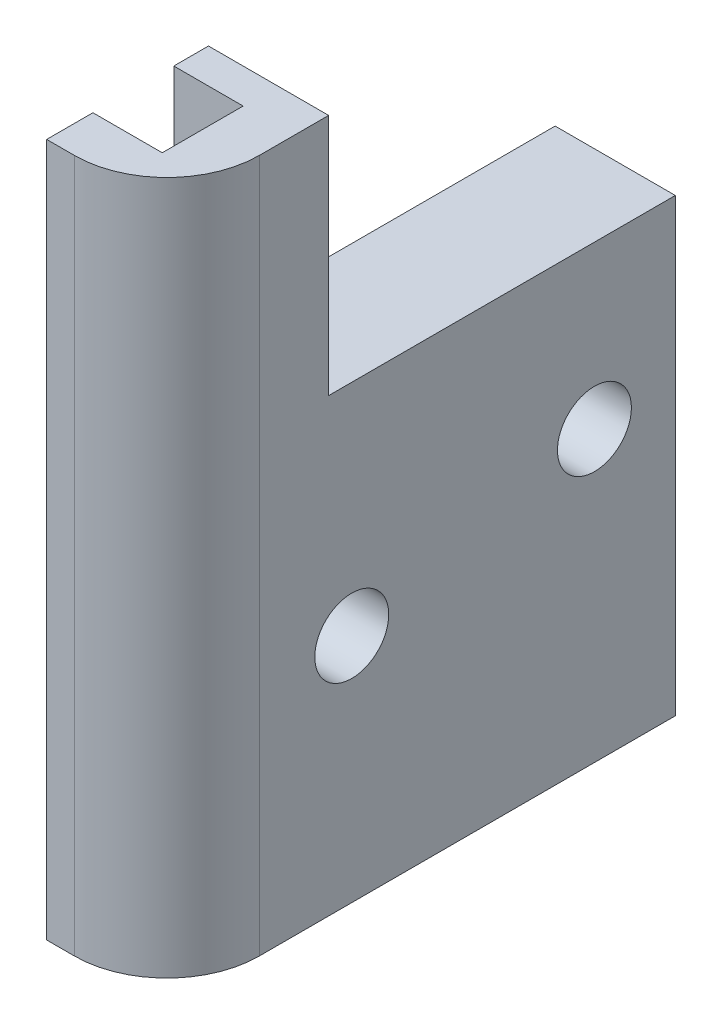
ISO-10303-21;
HEADER;
FILE_DESCRIPTION(('STEP AP214'),'2;1');
FILE_NAME('part.step','',(''),(''),'','','');
FILE_SCHEMA(('AUTOMOTIVE_DESIGN { 1 0 10303 214 1 1 1 1 }'));
ENDSEC;
DATA;
#1=APPLICATION_CONTEXT('core data for automotive mechanical design processes');
#2=APPLICATION_PROTOCOL_DEFINITION('international standard','automotive_design',2000,#1);
#3=PRODUCT_CONTEXT('',#1,'mechanical');
#4=PRODUCT('Part','Part','',(#3));
#5=PRODUCT_RELATED_PRODUCT_CATEGORY('part','',(#4));
#6=PRODUCT_DEFINITION_FORMATION('','',#4);
#7=PRODUCT_DEFINITION_CONTEXT('part definition',#1,'design');
#8=PRODUCT_DEFINITION('design','',#6,#7);
#9=PRODUCT_DEFINITION_SHAPE('','',#8);
#10=(LENGTH_UNIT() NAMED_UNIT(*) SI_UNIT(.MILLI.,.METRE.));
#11=(NAMED_UNIT(*) PLANE_ANGLE_UNIT() SI_UNIT($,.RADIAN.));
#12=(NAMED_UNIT(*) SI_UNIT($,.STERADIAN.) SOLID_ANGLE_UNIT());
#13=UNCERTAINTY_MEASURE_WITH_UNIT(LENGTH_MEASURE(1.E-05),#10,'distance_accuracy_value','');
#14=(GEOMETRIC_REPRESENTATION_CONTEXT(3) GLOBAL_UNCERTAINTY_ASSIGNED_CONTEXT((#13)) GLOBAL_UNIT_ASSIGNED_CONTEXT((#10,
#11,#12)) REPRESENTATION_CONTEXT('',''));
#15=CARTESIAN_POINT('',(0.,0.,0.));
#16=DIRECTION('',(0.,0.,1.));
#17=DIRECTION('',(1.,0.,0.));
#18=AXIS2_PLACEMENT_3D('',#15,#16,#17);
#19=CARTESIAN_POINT('',(5.2,19.5,0.));
#20=DIRECTION('',(0.,0.,1.));
#21=DIRECTION('',(1.,0.,0.));
#22=AXIS2_PLACEMENT_3D('',#19,#20,#21);
#23=PLANE('',#22);
#24=DIRECTION('',(0.,1.,0.));
#25=VECTOR('',#24,1.);
#26=CARTESIAN_POINT('',(0.,19.5,0.));
#27=LINE('',#26,#25);
#28=CARTESIAN_POINT('',(0.,0.,0.));
#29=VERTEX_POINT('',#28);
#30=CARTESIAN_POINT('',(0.,19.5,0.));
#31=VERTEX_POINT('',#30);
#32=EDGE_CURVE('E216',#29,#31,#27,.T.);
#33=ORIENTED_EDGE('',*,*,#32,.T.);
#34=DIRECTION('',(-1.,0.,0.));
#35=VECTOR('',#34,1.);
#36=CARTESIAN_POINT('',(5.2,19.5,0.));
#37=LINE('',#36,#35);
#38=CARTESIAN_POINT('',(5.2,19.5,0.));
#39=VERTEX_POINT('',#38);
#40=EDGE_CURVE('E261',#39,#31,#37,.T.);
#41=ORIENTED_EDGE('',*,*,#40,.F.);
#42=DIRECTION('',(0.,1.,0.));
#43=VECTOR('',#42,1.);
#44=CARTESIAN_POINT('',(5.2,19.5,0.));
#45=LINE('',#44,#43);
#46=CARTESIAN_POINT('',(5.2,0.,0.));
#47=VERTEX_POINT('',#46);
#48=EDGE_CURVE('E221',#47,#39,#45,.T.);
#49=ORIENTED_EDGE('',*,*,#48,.F.);
#50=DIRECTION('',(-1.,0.,0.));
#51=VECTOR('',#50,1.);
#52=CARTESIAN_POINT('',(5.2,0.,0.));
#53=LINE('',#52,#51);
#54=EDGE_CURVE('E234',#47,#29,#53,.T.);
#55=ORIENTED_EDGE('',*,*,#54,.T.);
#56=EDGE_LOOP('',(#33,#41,#49,#55));
#57=FACE_BOUND('',#56,.T.);
#58=ADVANCED_FACE('F33',(#57),#23,.F.);
#59=CARTESIAN_POINT('',(5.2,19.5,15.));
#60=DIRECTION('',(0.,-1.,0.));
#61=DIRECTION('',(0.,0.,-1.));
#62=AXIS2_PLACEMENT_3D('',#59,#60,#61);
#63=PLANE('',#62);
#64=DIRECTION('',(0.,0.,1.));
#65=VECTOR('',#64,1.);
#66=CARTESIAN_POINT('',(0.,19.5,15.));
#67=LINE('',#66,#65);
#68=CARTESIAN_POINT('',(0.,19.5,15.));
#69=VERTEX_POINT('',#68);
#70=EDGE_CURVE('E237',#31,#69,#67,.T.);
#71=ORIENTED_EDGE('',*,*,#70,.T.);
#72=DIRECTION('',(-1.,0.,0.));
#73=VECTOR('',#72,1.);
#74=CARTESIAN_POINT('',(5.2,19.5,15.));
#75=LINE('',#74,#73);
#76=CARTESIAN_POINT('',(5.2,19.5,15.));
#77=VERTEX_POINT('',#76);
#78=EDGE_CURVE('E258',#77,#69,#75,.T.);
#79=ORIENTED_EDGE('',*,*,#78,.F.);
#80=DIRECTION('',(0.,0.,1.));
#81=VECTOR('',#80,1.);
#82=CARTESIAN_POINT('',(5.2,19.5,15.));
#83=LINE('',#82,#81);
#84=EDGE_CURVE('E224',#39,#77,#83,.T.);
#85=ORIENTED_EDGE('',*,*,#84,.F.);
#86=ORIENTED_EDGE('',*,*,#40,.T.);
#87=EDGE_LOOP('',(#71,#79,#85,#86));
#88=FACE_BOUND('',#87,.T.);
#89=ADVANCED_FACE('F312',(#88),#63,.F.);
#90=CARTESIAN_POINT('',(5.2,30.,15.));
#91=DIRECTION('',(0.,0.,1.));
#92=DIRECTION('',(0.,-1.,0.));
#93=AXIS2_PLACEMENT_3D('',#90,#91,#92);
#94=PLANE('',#93);
#95=DIRECTION('',(0.,1.,0.));
#96=VECTOR('',#95,1.);
#97=CARTESIAN_POINT('',(0.,30.,15.));
#98=LINE('',#97,#96);
#99=CARTESIAN_POINT('',(0.,30.,15.));
#100=VERTEX_POINT('',#99);
#101=EDGE_CURVE('E239',#69,#100,#98,.T.);
#102=ORIENTED_EDGE('',*,*,#101,.T.);
#103=DIRECTION('',(-1.,0.,0.));
#104=VECTOR('',#103,1.);
#105=CARTESIAN_POINT('',(5.2,30.,15.));
#106=LINE('',#105,#104);
#107=CARTESIAN_POINT('',(5.2,30.,15.));
#108=VERTEX_POINT('',#107);
#109=EDGE_CURVE('E255',#108,#100,#106,.T.);
#110=ORIENTED_EDGE('',*,*,#109,.F.);
#111=DIRECTION('',(0.,1.,0.));
#112=VECTOR('',#111,1.);
#113=CARTESIAN_POINT('',(5.2,30.,15.));
#114=LINE('',#113,#112);
#115=EDGE_CURVE('E227',#77,#108,#114,.T.);
#116=ORIENTED_EDGE('',*,*,#115,.F.);
#117=ORIENTED_EDGE('',*,*,#78,.T.);
#118=EDGE_LOOP('',(#102,#110,#116,#117));
#119=FACE_BOUND('',#118,.T.);
#120=ADVANCED_FACE('F315',(#119),#94,.F.);
#121=CARTESIAN_POINT('',(5.2,30.,22.));
#122=DIRECTION('',(0.,-1.,0.));
#123=DIRECTION('',(0.,0.,-1.));
#124=AXIS2_PLACEMENT_3D('',#121,#122,#123);
#125=PLANE('',#124);
#126=DIRECTION('',(-1.,0.,0.));
#127=VECTOR('',#126,1.);
#128=CARTESIAN_POINT('',(5.2,30.,22.));
#129=LINE('',#128,#127);
#130=CARTESIAN_POINT('',(1.2,30.,22.));
#131=VERTEX_POINT('',#130);
#132=CARTESIAN_POINT('',(0.,30.,22.));
#133=VERTEX_POINT('',#132);
#134=EDGE_CURVE('E253',#131,#133,#129,.T.);
#135=ORIENTED_EDGE('',*,*,#134,.F.);
#136=CARTESIAN_POINT('',(1.2,30.,18.));
#137=DIRECTION('',(0.,-1.,0.));
#138=DIRECTION('',(0.,0.,-1.));
#139=AXIS2_PLACEMENT_3D('',#136,#137,#138);
#140=CIRCLE('',#139,4.);
#141=CARTESIAN_POINT('',(5.2,30.,18.));
#142=VERTEX_POINT('',#141);
#143=EDGE_CURVE('E11',#131,#142,#140,.F.);
#144=ORIENTED_EDGE('',*,*,#143,.T.);
#145=DIRECTION('',(0.,0.,1.));
#146=VECTOR('',#145,1.);
#147=CARTESIAN_POINT('',(5.2,30.,22.));
#148=LINE('',#147,#146);
#149=EDGE_CURVE('E229',#108,#142,#148,.T.);
#150=ORIENTED_EDGE('',*,*,#149,.F.);
#151=ORIENTED_EDGE('',*,*,#109,.T.);
#152=DIRECTION('',(0.,0.,1.));
#153=VECTOR('',#152,1.);
#154=CARTESIAN_POINT('',(0.,30.,22.));
#155=LINE('',#154,#153);
#156=CARTESIAN_POINT('',(0.,30.,16.5));
#157=VERTEX_POINT('',#156);
#158=EDGE_CURVE('E242',#100,#157,#155,.T.);
#159=ORIENTED_EDGE('',*,*,#158,.T.);
#160=DIRECTION('',(-1.,0.,0.));
#161=VECTOR('',#160,1.);
#162=CARTESIAN_POINT('',(3.,30.,16.5));
#163=LINE('',#162,#161);
#164=CARTESIAN_POINT('',(3.,30.,16.5));
#165=VERTEX_POINT('',#164);
#166=EDGE_CURVE('E177',#165,#157,#163,.T.);
#167=ORIENTED_EDGE('',*,*,#166,.F.);
#168=DIRECTION('',(0.,0.,-1.));
#169=VECTOR('',#168,1.);
#170=CARTESIAN_POINT('',(3.,30.,20.));
#171=LINE('',#170,#169);
#172=CARTESIAN_POINT('',(3.,30.,20.));
#173=VERTEX_POINT('',#172);
#174=EDGE_CURVE('E187',#173,#165,#171,.T.);
#175=ORIENTED_EDGE('',*,*,#174,.F.);
#176=DIRECTION('',(-1.,0.,0.));
#177=VECTOR('',#176,1.);
#178=CARTESIAN_POINT('',(3.,30.,20.));
#179=LINE('',#178,#177);
#180=CARTESIAN_POINT('',(0.,30.,20.));
#181=VERTEX_POINT('',#180);
#182=EDGE_CURVE('E213',#173,#181,#179,.T.);
#183=ORIENTED_EDGE('',*,*,#182,.T.);
#184=EDGE_CURVE('E241',#181,#133,#155,.T.);
#185=ORIENTED_EDGE('',*,*,#184,.T.);
#186=EDGE_LOOP('',(#135,#144,#150,#151,#159,#167,#175,#183,#185));
#187=FACE_BOUND('',#186,.T.);
#188=ADVANCED_FACE('F318',(#187),#125,.F.);
#189=CARTESIAN_POINT('',(5.2,0.,22.));
#190=DIRECTION('',(0.,0.,-1.));
#191=DIRECTION('',(-1.,0.,0.));
#192=AXIS2_PLACEMENT_3D('',#189,#190,#191);
#193=PLANE('',#192);
#194=DIRECTION('',(-1.,0.,0.));
#195=VECTOR('',#194,1.);
#196=CARTESIAN_POINT('',(5.2,0.,22.));
#197=LINE('',#196,#195);
#198=CARTESIAN_POINT('',(1.2,0.,22.));
#199=VERTEX_POINT('',#198);
#200=CARTESIAN_POINT('',(0.,0.,22.));
#201=VERTEX_POINT('',#200);
#202=EDGE_CURVE('E251',#199,#201,#197,.T.);
#203=ORIENTED_EDGE('',*,*,#202,.F.);
#204=DIRECTION('',(0.,-1.,0.));
#205=VECTOR('',#204,1.);
#206=CARTESIAN_POINT('',(1.2,0.,22.));
#207=LINE('',#206,#205);
#208=EDGE_CURVE('E41',#199,#131,#207,.F.);
#209=ORIENTED_EDGE('',*,*,#208,.T.);
#210=ORIENTED_EDGE('',*,*,#134,.T.);
#211=DIRECTION('',(0.,-1.,0.));
#212=VECTOR('',#211,1.);
#213=CARTESIAN_POINT('',(0.,0.,22.));
#214=LINE('',#213,#212);
#215=EDGE_CURVE('E245',#133,#201,#214,.T.);
#216=ORIENTED_EDGE('',*,*,#215,.T.);
#217=EDGE_LOOP('',(#203,#209,#210,#216));
#218=FACE_BOUND('',#217,.T.);
#219=ADVANCED_FACE('F387',(#218),#193,.F.);
#220=CARTESIAN_POINT('',(5.2,0.,0.));
#221=DIRECTION('',(0.,1.,0.));
#222=DIRECTION('',(0.,0.,1.));
#223=AXIS2_PLACEMENT_3D('',#220,#221,#222);
#224=PLANE('',#223);
#225=DIRECTION('',(0.,0.,-1.));
#226=VECTOR('',#225,1.);
#227=CARTESIAN_POINT('',(5.2,0.,0.));
#228=LINE('',#227,#226);
#229=CARTESIAN_POINT('',(5.2,0.,18.));
#230=VERTEX_POINT('',#229);
#231=EDGE_CURVE('E232',#230,#47,#228,.T.);
#232=ORIENTED_EDGE('',*,*,#231,.F.);
#233=CARTESIAN_POINT('',(1.2,0.,18.));
#234=DIRECTION('',(0.,1.,0.));
#235=DIRECTION('',(0.,0.,1.));
#236=AXIS2_PLACEMENT_3D('',#233,#234,#235);
#237=CIRCLE('',#236,4.);
#238=EDGE_CURVE('E55',#230,#199,#237,.F.);
#239=ORIENTED_EDGE('',*,*,#238,.T.);
#240=ORIENTED_EDGE('',*,*,#202,.T.);
#241=DIRECTION('',(0.,0.,-1.));
#242=VECTOR('',#241,1.);
#243=CARTESIAN_POINT('',(0.,0.,0.));
#244=LINE('',#243,#242);
#245=EDGE_CURVE('E225',#201,#29,#244,.T.);
#246=ORIENTED_EDGE('',*,*,#245,.T.);
#247=ORIENTED_EDGE('',*,*,#54,.F.);
#248=EDGE_LOOP('',(#232,#239,#240,#246,#247));
#249=FACE_BOUND('',#248,.T.);
#250=ADVANCED_FACE('F302',(#249),#224,.F.);
#251=CARTESIAN_POINT('',(5.2,0.,0.));
#252=DIRECTION('',(-1.,0.,0.));
#253=DIRECTION('',(0.,0.,1.));
#254=AXIS2_PLACEMENT_3D('',#251,#252,#253);
#255=PLANE('',#254);
#256=CARTESIAN_POINT('',(5.2,10.,14.));
#257=DIRECTION('',(1.,0.,0.));
#258=DIRECTION('',(0.,0.,-1.));
#259=AXIS2_PLACEMENT_3D('',#256,#257,#258);
#260=CIRCLE('',#259,1.6);
#261=CARTESIAN_POINT('',(5.2,10.,12.4));
#262=VERTEX_POINT('',#261);
#263=EDGE_CURVE('E166',#262,#262,#260,.T.);
#264=ORIENTED_EDGE('',*,*,#263,.F.);
#265=EDGE_LOOP('',(#264));
#266=FACE_BOUND('',#265,.T.);
#267=CARTESIAN_POINT('',(5.2,12.5,3.5));
#268=DIRECTION('',(1.,0.,0.));
#269=DIRECTION('',(0.,0.,-1.));
#270=AXIS2_PLACEMENT_3D('',#267,#268,#269);
#271=CIRCLE('',#270,1.6);
#272=CARTESIAN_POINT('',(5.2,12.5,1.9));
#273=VERTEX_POINT('',#272);
#274=EDGE_CURVE('E550',#273,#273,#271,.T.);
#275=ORIENTED_EDGE('',*,*,#274,.F.);
#276=EDGE_LOOP('',(#275));
#277=FACE_BOUND('',#276,.T.);
#278=ORIENTED_EDGE('',*,*,#149,.T.);
#279=DIRECTION('',(0.,-1.,0.));
#280=VECTOR('',#279,1.);
#281=CARTESIAN_POINT('',(5.2,0.,18.));
#282=LINE('',#281,#280);
#283=EDGE_CURVE('E292',#142,#230,#282,.T.);
#284=ORIENTED_EDGE('',*,*,#283,.T.);
#285=ORIENTED_EDGE('',*,*,#231,.T.);
#286=ORIENTED_EDGE('',*,*,#48,.T.);
#287=ORIENTED_EDGE('',*,*,#84,.T.);
#288=ORIENTED_EDGE('',*,*,#115,.T.);
#289=EDGE_LOOP('',(#278,#284,#285,#286,#287,#288));
#290=FACE_BOUND('',#289,.T.);
#291=ADVANCED_FACE('F297',(#266,#277,#290),#255,.F.);
#292=CARTESIAN_POINT('',(0.,0.,0.));
#293=DIRECTION('',(-1.,0.,0.));
#294=DIRECTION('',(0.,0.,1.));
#295=AXIS2_PLACEMENT_3D('',#292,#293,#294);
#296=PLANE('',#295);
#297=CARTESIAN_POINT('',(0.,10.,14.));
#298=DIRECTION('',(-1.,0.,0.));
#299=DIRECTION('',(0.,0.,1.));
#300=AXIS2_PLACEMENT_3D('',#297,#298,#299);
#301=CIRCLE('',#300,1.6);
#302=CARTESIAN_POINT('',(0.,10.,15.6));
#303=VERTEX_POINT('',#302);
#304=EDGE_CURVE('E546',#303,#303,#301,.F.);
#305=ORIENTED_EDGE('',*,*,#304,.T.);
#306=EDGE_LOOP('',(#305));
#307=FACE_BOUND('',#306,.T.);
#308=CARTESIAN_POINT('',(0.,12.5,3.5));
#309=DIRECTION('',(-1.,0.,0.));
#310=DIRECTION('',(0.,0.,1.));
#311=AXIS2_PLACEMENT_3D('',#308,#309,#310);
#312=CIRCLE('',#311,1.6);
#313=CARTESIAN_POINT('',(0.,12.5,5.1));
#314=VERTEX_POINT('',#313);
#315=EDGE_CURVE('E549',#314,#314,#312,.F.);
#316=ORIENTED_EDGE('',*,*,#315,.T.);
#317=EDGE_LOOP('',(#316));
#318=FACE_BOUND('',#317,.T.);
#319=DIRECTION('',(0.,0.37303194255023,-0.927818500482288));
#320=VECTOR('',#319,1.);
#321=CARTESIAN_POINT('',(0.,9.94870290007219,6.67864374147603));
#322=LINE('',#321,#320);
#323=CARTESIAN_POINT('',(0.,7.65609364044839,12.3809041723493));
#324=VERTEX_POINT('',#323);
#325=CARTESIAN_POINT('',(0.,9.94870290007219,6.67864374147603));
#326=VERTEX_POINT('',#325);
#327=EDGE_CURVE('E172',#324,#326,#322,.T.);
#328=ORIENTED_EDGE('',*,*,#327,.F.);
#329=CARTESIAN_POINT('',(0.,10.4395491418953,13.5));
#330=DIRECTION('',(-1.,0.,0.));
#331=DIRECTION('',(0.,0.,1.));
#332=AXIS2_PLACEMENT_3D('',#329,#330,#331);
#333=CIRCLE('',#332,3.);
#334=CARTESIAN_POINT('',(0.,10.4395491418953,16.5));
#335=VERTEX_POINT('',#334);
#336=EDGE_CURVE('E273',#324,#335,#333,.T.);
#337=ORIENTED_EDGE('',*,*,#336,.T.);
#338=DIRECTION('',(0.,-1.,0.));
#339=VECTOR('',#338,1.);
#340=CARTESIAN_POINT('',(0.,30.,16.5));
#341=LINE('',#340,#339);
#342=EDGE_CURVE('E183',#157,#335,#341,.T.);
#343=ORIENTED_EDGE('',*,*,#342,.F.);
#344=ORIENTED_EDGE('',*,*,#158,.F.);
#345=ORIENTED_EDGE('',*,*,#101,.F.);
#346=ORIENTED_EDGE('',*,*,#70,.F.);
#347=ORIENTED_EDGE('',*,*,#32,.F.);
#348=ORIENTED_EDGE('',*,*,#245,.F.);
#349=ORIENTED_EDGE('',*,*,#215,.F.);
#350=ORIENTED_EDGE('',*,*,#184,.F.);
#351=DIRECTION('',(0.,1.,0.));
#352=VECTOR('',#351,1.);
#353=CARTESIAN_POINT('',(0.,2.5,20.));
#354=LINE('',#353,#352);
#355=CARTESIAN_POINT('',(0.,5.5,20.));
#356=VERTEX_POINT('',#355);
#357=EDGE_CURVE('E191',#356,#181,#354,.T.);
#358=ORIENTED_EDGE('',*,*,#357,.F.);
#359=CARTESIAN_POINT('',(0.,5.5,17.));
#360=DIRECTION('',(-1.,0.,0.));
#361=DIRECTION('',(0.,0.,1.));
#362=AXIS2_PLACEMENT_3D('',#359,#360,#361);
#363=CIRCLE('',#362,3.);
#364=CARTESIAN_POINT('',(0.,2.5,17.));
#365=VERTEX_POINT('',#364);
#366=EDGE_CURVE('E277',#356,#365,#363,.F.);
#367=ORIENTED_EDGE('',*,*,#366,.T.);
#368=DIRECTION('',(0.,0.,1.));
#369=VECTOR('',#368,1.);
#370=CARTESIAN_POINT('',(0.,2.5,16.5));
#371=LINE('',#370,#369);
#372=CARTESIAN_POINT('',(0.,2.5,16.5));
#373=VERTEX_POINT('',#372);
#374=EDGE_CURVE('E209',#373,#365,#371,.T.);
#375=ORIENTED_EDGE('',*,*,#374,.F.);
#376=DIRECTION('',(0.,0.108325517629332,0.994115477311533));
#377=VECTOR('',#376,1.);
#378=CARTESIAN_POINT('',(0.,1.3,5.48746482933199));
#379=LINE('',#378,#377);
#380=CARTESIAN_POINT('',(0.,1.3,5.48746482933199));
#381=VERTEX_POINT('',#380);
#382=EDGE_CURVE('E206',#381,#373,#379,.T.);
#383=ORIENTED_EDGE('',*,*,#382,.F.);
#384=CARTESIAN_POINT('',(0.,5.7735196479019,5.));
#385=DIRECTION('',(-1.,0.,0.));
#386=DIRECTION('',(0.,0.,1.));
#387=AXIS2_PLACEMENT_3D('',#384,#385,#386);
#388=CIRCLE('',#387,4.5);
#389=EDGE_CURVE('E204',#326,#381,#388,.T.);
#390=ORIENTED_EDGE('',*,*,#389,.F.);
#391=EDGE_LOOP('',(#328,#337,#343,#344,#345,#346,#347,#348,#349,#350,#358,#367,#375,#383,#390));
#392=FACE_BOUND('',#391,.T.);
#393=ADVANCED_FACE('F368',(#307,#318,#392),#296,.T.);
#394=CARTESIAN_POINT('',(3.,2.5,20.));
#395=DIRECTION('',(0.,0.,1.));
#396=DIRECTION('',(1.,0.,0.));
#397=AXIS2_PLACEMENT_3D('',#394,#395,#396);
#398=PLANE('',#397);
#399=DIRECTION('',(0.,1.,0.));
#400=VECTOR('',#399,1.);
#401=CARTESIAN_POINT('',(3.,2.5,20.));
#402=LINE('',#401,#400);
#403=CARTESIAN_POINT('',(3.,5.5,20.));
#404=VERTEX_POINT('',#403);
#405=EDGE_CURVE('E199',#404,#173,#402,.T.);
#406=ORIENTED_EDGE('',*,*,#405,.F.);
#407=DIRECTION('',(-1.,0.,0.));
#408=VECTOR('',#407,1.);
#409=CARTESIAN_POINT('',(0.,5.5,20.));
#410=LINE('',#409,#408);
#411=EDGE_CURVE('E264',#404,#356,#410,.T.);
#412=ORIENTED_EDGE('',*,*,#411,.T.);
#413=ORIENTED_EDGE('',*,*,#357,.T.);
#414=ORIENTED_EDGE('',*,*,#182,.F.);
#415=EDGE_LOOP('',(#406,#412,#413,#414));
#416=FACE_BOUND('',#415,.T.);
#417=ADVANCED_FACE('F380',(#416),#398,.F.);
#418=CARTESIAN_POINT('',(3.,2.5,16.5));
#419=DIRECTION('',(0.,-1.,0.));
#420=DIRECTION('',(0.,0.,-1.));
#421=AXIS2_PLACEMENT_3D('',#418,#419,#420);
#422=PLANE('',#421);
#423=ORIENTED_EDGE('',*,*,#374,.T.);
#424=DIRECTION('',(-1.,0.,0.));
#425=VECTOR('',#424,1.);
#426=CARTESIAN_POINT('',(3.,2.5,17.));
#427=LINE('',#426,#425);
#428=CARTESIAN_POINT('',(3.,2.5,17.));
#429=VERTEX_POINT('',#428);
#430=EDGE_CURVE('E267',#365,#429,#427,.F.);
#431=ORIENTED_EDGE('',*,*,#430,.T.);
#432=DIRECTION('',(0.,0.,1.));
#433=VECTOR('',#432,1.);
#434=CARTESIAN_POINT('',(3.,2.5,16.5));
#435=LINE('',#434,#433);
#436=CARTESIAN_POINT('',(3.,2.5,16.5));
#437=VERTEX_POINT('',#436);
#438=EDGE_CURVE('E196',#437,#429,#435,.T.);
#439=ORIENTED_EDGE('',*,*,#438,.F.);
#440=DIRECTION('',(-1.,0.,0.));
#441=VECTOR('',#440,1.);
#442=CARTESIAN_POINT('',(3.,2.5,16.5));
#443=LINE('',#442,#441);
#444=EDGE_CURVE('E217',#437,#373,#443,.T.);
#445=ORIENTED_EDGE('',*,*,#444,.T.);
#446=EDGE_LOOP('',(#423,#431,#439,#445));
#447=FACE_BOUND('',#446,.T.);
#448=ADVANCED_FACE('F374',(#447),#422,.F.);
#449=CARTESIAN_POINT('',(3.,1.3,5.48746482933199));
#450=DIRECTION('',(0.,-0.994115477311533,0.108325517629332));
#451=DIRECTION('',(0.,-0.108325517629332,-0.994115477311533));
#452=AXIS2_PLACEMENT_3D('',#449,#450,#451);
#453=PLANE('',#452);
#454=DIRECTION('',(0.,0.108325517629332,0.994115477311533));
#455=VECTOR('',#454,1.);
#456=CARTESIAN_POINT('',(3.,1.3,5.48746482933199));
#457=LINE('',#456,#455);
#458=CARTESIAN_POINT('',(3.,2.24582390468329,14.1673973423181));
#459=VERTEX_POINT('',#458);
#460=EDGE_CURVE('E194',#459,#437,#457,.T.);
#461=ORIENTED_EDGE('',*,*,#460,.F.);
#462=DIRECTION('',(0.499999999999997,-0.093812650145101,-0.860929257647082));
#463=VECTOR('',#462,1.);
#464=CARTESIAN_POINT('',(4.3,2.00191101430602,11.9289812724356));
#465=LINE('',#464,#463);
#466=CARTESIAN_POINT('',(4.3,2.00191101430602,11.9289812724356));
#467=VERTEX_POINT('',#466);
#468=EDGE_CURVE('E287',#459,#467,#465,.T.);
#469=ORIENTED_EDGE('',*,*,#468,.T.);
#470=DIRECTION('',(0.,0.108325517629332,0.994115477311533));
#471=VECTOR('',#470,1.);
#472=CARTESIAN_POINT('',(4.3,1.3,5.48746482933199));
#473=LINE('',#472,#471);
#474=CARTESIAN_POINT('',(4.3,1.3,5.48746482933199));
#475=VERTEX_POINT('',#474);
#476=EDGE_CURVE('E181',#475,#467,#473,.T.);
#477=ORIENTED_EDGE('',*,*,#476,.F.);
#478=DIRECTION('',(-1.,0.,0.));
#479=VECTOR('',#478,1.);
#480=CARTESIAN_POINT('',(3.,1.3,5.48746482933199));
#481=LINE('',#480,#479);
#482=EDGE_CURVE('E176',#475,#381,#481,.T.);
#483=ORIENTED_EDGE('',*,*,#482,.T.);
#484=ORIENTED_EDGE('',*,*,#382,.T.);
#485=ORIENTED_EDGE('',*,*,#444,.F.);
#486=EDGE_LOOP('',(#461,#469,#477,#483,#484,#485));
#487=FACE_BOUND('',#486,.T.);
#488=ADVANCED_FACE('F358',(#487),#453,.F.);
#489=CARTESIAN_POINT('',(3.,5.7735196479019,5.));
#490=DIRECTION('',(-1.,0.,0.));
#491=DIRECTION('',(0.,0.,1.));
#492=AXIS2_PLACEMENT_3D('',#489,#490,#491);
#493=CYLINDRICAL_SURFACE('',#492,4.5);
#494=ORIENTED_EDGE('',*,*,#389,.T.);
#495=ORIENTED_EDGE('',*,*,#482,.F.);
#496=CARTESIAN_POINT('',(4.3,5.7735196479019,5.));
#497=DIRECTION('',(-1.,0.,0.));
#498=DIRECTION('',(0.,0.,1.));
#499=AXIS2_PLACEMENT_3D('',#496,#497,#498);
#500=CIRCLE('',#499,4.5);
#501=CARTESIAN_POINT('',(4.3,9.94870290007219,6.67864374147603));
#502=VERTEX_POINT('',#501);
#503=EDGE_CURVE('E162',#502,#475,#500,.T.);
#504=ORIENTED_EDGE('',*,*,#503,.F.);
#505=DIRECTION('',(-1.,0.,0.));
#506=VECTOR('',#505,1.);
#507=CARTESIAN_POINT('',(3.,9.94870290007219,6.67864374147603));
#508=LINE('',#507,#506);
#509=EDGE_CURVE('E169',#502,#326,#508,.T.);
#510=ORIENTED_EDGE('',*,*,#509,.T.);
#511=EDGE_LOOP('',(#494,#495,#504,#510));
#512=FACE_BOUND('',#511,.T.);
#513=ADVANCED_FACE('F179',(#512),#493,.F.);
#514=CARTESIAN_POINT('',(3.,9.94870290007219,6.67864374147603));
#515=DIRECTION('',(0.,0.927818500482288,0.37303194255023));
#516=DIRECTION('',(0.,-0.37303194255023,0.927818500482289));
#517=AXIS2_PLACEMENT_3D('',#514,#515,#516);
#518=PLANE('',#517);
#519=DIRECTION('',(0.,0.37303194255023,-0.927818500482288));
#520=VECTOR('',#519,1.);
#521=CARTESIAN_POINT('',(4.3,7.65609364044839,12.3809041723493));
#522=LINE('',#521,#520);
#523=CARTESIAN_POINT('',(4.3,8.10517680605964,11.2639283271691));
#524=VERTEX_POINT('',#523);
#525=EDGE_CURVE('E157',#524,#502,#522,.T.);
#526=ORIENTED_EDGE('',*,*,#525,.F.);
#527=DIRECTION('',(-0.453755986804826,-0.332418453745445,0.826803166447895));
#528=VECTOR('',#527,1.);
#529=CARTESIAN_POINT('',(4.69612332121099,8.39537397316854,10.5421394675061));
#530=LINE('',#529,#528);
#531=CARTESIAN_POINT('',(3.68699499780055,7.65609364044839,12.3809041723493));
#532=VERTEX_POINT('',#531);
#533=EDGE_CURVE('E285',#524,#532,#530,.T.);
#534=ORIENTED_EDGE('',*,*,#533,.T.);
#535=DIRECTION('',(-1.,0.,0.));
#536=VECTOR('',#535,1.);
#537=CARTESIAN_POINT('',(3.,7.65609364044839,12.3809041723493));
#538=LINE('',#537,#536);
#539=EDGE_CURVE('E271',#532,#324,#538,.T.);
#540=ORIENTED_EDGE('',*,*,#539,.T.);
#541=ORIENTED_EDGE('',*,*,#327,.T.);
#542=ORIENTED_EDGE('',*,*,#509,.F.);
#543=EDGE_LOOP('',(#526,#534,#540,#541,#542));
#544=FACE_BOUND('',#543,.T.);
#545=ADVANCED_FACE('F170',(#544),#518,.F.);
#546=CARTESIAN_POINT('',(3.,30.,16.5));
#547=DIRECTION('',(0.,0.,-1.));
#548=DIRECTION('',(-1.,0.,0.));
#549=AXIS2_PLACEMENT_3D('',#546,#547,#548);
#550=PLANE('',#549);
#551=ORIENTED_EDGE('',*,*,#342,.T.);
#552=DIRECTION('',(-1.,0.,0.));
#553=VECTOR('',#552,1.);
#554=CARTESIAN_POINT('',(3.,10.4395491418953,16.5));
#555=LINE('',#554,#553);
#556=CARTESIAN_POINT('',(3.,10.4395491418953,16.5));
#557=VERTEX_POINT('',#556);
#558=EDGE_CURVE('E275',#335,#557,#555,.F.);
#559=ORIENTED_EDGE('',*,*,#558,.T.);
#560=DIRECTION('',(0.,-1.,0.));
#561=VECTOR('',#560,1.);
#562=CARTESIAN_POINT('',(3.,30.,16.5));
#563=LINE('',#562,#561);
#564=EDGE_CURVE('E190',#165,#557,#563,.T.);
#565=ORIENTED_EDGE('',*,*,#564,.F.);
#566=ORIENTED_EDGE('',*,*,#166,.T.);
#567=EDGE_LOOP('',(#551,#559,#565,#566));
#568=FACE_BOUND('',#567,.T.);
#569=ADVANCED_FACE('F385',(#568),#550,.F.);
#570=CARTESIAN_POINT('',(3.,5.7735196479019,5.));
#571=DIRECTION('',(-1.,0.,0.));
#572=DIRECTION('',(0.,0.,1.));
#573=AXIS2_PLACEMENT_3D('',#570,#571,#572);
#574=PLANE('',#573);
#575=CARTESIAN_POINT('',(3.,10.4395491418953,13.5));
#576=DIRECTION('',(-1.,0.,0.));
#577=DIRECTION('',(0.,0.,1.));
#578=AXIS2_PLACEMENT_3D('',#575,#576,#577);
#579=CIRCLE('',#578,3.);
#580=CARTESIAN_POINT('',(3.,7.44125882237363,13.6012677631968));
#581=VERTEX_POINT('',#580);
#582=EDGE_CURVE('E279',#557,#581,#579,.F.);
#583=ORIENTED_EDGE('',*,*,#582,.T.);
#584=DIRECTION('',(0.,-0.994115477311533,0.108325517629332));
#585=VECTOR('',#584,1.);
#586=CARTESIAN_POINT('',(3.,10.4152712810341,13.2771993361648));
#587=LINE('',#586,#585);
#588=EDGE_CURVE('E289',#581,#459,#587,.T.);
#589=ORIENTED_EDGE('',*,*,#588,.T.);
#590=ORIENTED_EDGE('',*,*,#460,.T.);
#591=ORIENTED_EDGE('',*,*,#438,.T.);
#592=CARTESIAN_POINT('',(3.,5.5,17.));
#593=DIRECTION('',(-1.,0.,0.));
#594=DIRECTION('',(0.,0.,1.));
#595=AXIS2_PLACEMENT_3D('',#592,#593,#594);
#596=CIRCLE('',#595,3.);
#597=EDGE_CURVE('E269',#429,#404,#596,.T.);
#598=ORIENTED_EDGE('',*,*,#597,.T.);
#599=ORIENTED_EDGE('',*,*,#405,.T.);
#600=ORIENTED_EDGE('',*,*,#174,.T.);
#601=ORIENTED_EDGE('',*,*,#564,.T.);
#602=EDGE_LOOP('',(#583,#589,#590,#591,#598,#599,#600,#601));
#603=FACE_BOUND('',#602,.T.);
#604=ADVANCED_FACE('F340',(#603),#574,.T.);
#605=CARTESIAN_POINT('',(3.,5.5,17.));
#606=DIRECTION('',(1.,0.,0.));
#607=DIRECTION('',(0.,0.,-1.));
#608=AXIS2_PLACEMENT_3D('',#605,#606,#607);
#609=CYLINDRICAL_SURFACE('',#608,3.);
#610=ORIENTED_EDGE('',*,*,#597,.F.);
#611=ORIENTED_EDGE('',*,*,#430,.F.);
#612=ORIENTED_EDGE('',*,*,#366,.F.);
#613=ORIENTED_EDGE('',*,*,#411,.F.);
#614=EDGE_LOOP('',(#610,#611,#612,#613));
#615=FACE_BOUND('',#614,.T.);
#616=ADVANCED_FACE('F336',(#615),#609,.F.);
#617=CARTESIAN_POINT('',(3.,10.4395491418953,13.5));
#618=DIRECTION('',(-1.,0.,0.));
#619=DIRECTION('',(0.,0.,1.));
#620=AXIS2_PLACEMENT_3D('',#617,#618,#619);
#621=CYLINDRICAL_SURFACE('',#620,3.);
#622=CARTESIAN_POINT('',(2.87060454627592,10.4395491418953,13.5));
#623=DIRECTION('',(0.86602540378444,0.0541627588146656,0.497057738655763));
#624=DIRECTION('',(-0.499999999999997,0.0938126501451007,0.860929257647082));
#625=AXIS2_PLACEMENT_3D('',#622,#623,#624);
#626=ELLIPSE('',#625,3.46410161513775,3.);
#627=EDGE_CURVE('E282',#532,#581,#626,.F.);
#628=ORIENTED_EDGE('',*,*,#627,.T.);
#629=ORIENTED_EDGE('',*,*,#582,.F.);
#630=ORIENTED_EDGE('',*,*,#558,.F.);
#631=ORIENTED_EDGE('',*,*,#336,.F.);
#632=ORIENTED_EDGE('',*,*,#539,.F.);
#633=EDGE_LOOP('',(#628,#629,#630,#631,#632));
#634=FACE_BOUND('',#633,.T.);
#635=ADVANCED_FACE('F339',(#634),#621,.T.);
#636=CARTESIAN_POINT('',(4.3,10.4395491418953,13.5));
#637=DIRECTION('',(-1.,0.,0.));
#638=DIRECTION('',(0.,0.,1.));
#639=AXIS2_PLACEMENT_3D('',#636,#637,#638);
#640=PLANE('',#639);
#641=ORIENTED_EDGE('',*,*,#476,.T.);
#642=DIRECTION('',(0.,0.994115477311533,-0.108325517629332));
#643=VECTOR('',#642,1.);
#644=CARTESIAN_POINT('',(4.3,10.1713583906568,11.0387832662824));
#645=LINE('',#644,#643);
#646=EDGE_CURVE('E164',#467,#524,#645,.T.);
#647=ORIENTED_EDGE('',*,*,#646,.T.);
#648=ORIENTED_EDGE('',*,*,#525,.T.);
#649=ORIENTED_EDGE('',*,*,#503,.T.);
#650=EDGE_LOOP('',(#641,#647,#648,#649));
#651=FACE_BOUND('',#650,.T.);
#652=ADVANCED_FACE('F160',(#651),#640,.T.);
#653=CARTESIAN_POINT('',(4.3,10.1713583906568,11.0387832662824));
#654=DIRECTION('',(0.86602540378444,0.0541627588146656,0.497057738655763));
#655=DIRECTION('',(0.,0.994115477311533,-0.108325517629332));
#656=AXIS2_PLACEMENT_3D('',#653,#654,#655);
#657=PLANE('',#656);
#658=ORIENTED_EDGE('',*,*,#468,.F.);
#659=ORIENTED_EDGE('',*,*,#588,.F.);
#660=ORIENTED_EDGE('',*,*,#627,.F.);
#661=ORIENTED_EDGE('',*,*,#533,.F.);
#662=ORIENTED_EDGE('',*,*,#646,.F.);
#663=EDGE_LOOP('',(#658,#659,#660,#661,#662));
#664=FACE_BOUND('',#663,.T.);
#665=ADVANCED_FACE('F344',(#664),#657,.F.);
#666=CARTESIAN_POINT('',(-0.00100000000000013,12.5,3.5));
#667=DIRECTION('',(1.,0.,0.));
#668=DIRECTION('',(0.,0.,-1.));
#669=AXIS2_PLACEMENT_3D('',#666,#667,#668);
#670=CYLINDRICAL_SURFACE('',#669,1.6);
#671=ORIENTED_EDGE('',*,*,#315,.F.);
#672=EDGE_LOOP('',(#671));
#673=FACE_BOUND('',#672,.T.);
#674=ORIENTED_EDGE('',*,*,#274,.T.);
#675=EDGE_LOOP('',(#674));
#676=FACE_BOUND('',#675,.T.);
#677=ADVANCED_FACE('F325',(#673,#676),#670,.F.);
#678=CARTESIAN_POINT('',(-0.00100000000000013,10.,14.));
#679=DIRECTION('',(1.,0.,0.));
#680=DIRECTION('',(0.,0.,-1.));
#681=AXIS2_PLACEMENT_3D('',#678,#679,#680);
#682=CYLINDRICAL_SURFACE('',#681,1.6);
#683=ORIENTED_EDGE('',*,*,#304,.F.);
#684=EDGE_LOOP('',(#683));
#685=FACE_BOUND('',#684,.T.);
#686=ORIENTED_EDGE('',*,*,#263,.T.);
#687=EDGE_LOOP('',(#686));
#688=FACE_BOUND('',#687,.T.);
#689=ADVANCED_FACE('F321',(#685,#688),#682,.F.);
#690=CARTESIAN_POINT('',(1.2,0.,18.));
#691=DIRECTION('',(0.,-1.,0.));
#692=DIRECTION('',(0.,0.,-1.));
#693=AXIS2_PLACEMENT_3D('',#690,#691,#692);
#694=CYLINDRICAL_SURFACE('',#693,4.);
#695=ORIENTED_EDGE('',*,*,#143,.F.);
#696=ORIENTED_EDGE('',*,*,#208,.F.);
#697=ORIENTED_EDGE('',*,*,#238,.F.);
#698=ORIENTED_EDGE('',*,*,#283,.F.);
#699=EDGE_LOOP('',(#695,#696,#697,#698));
#700=FACE_BOUND('',#699,.T.);
#701=ADVANCED_FACE('F35',(#700),#694,.T.);
#702=CLOSED_SHELL('',(#58,#89,#120,#188,#219,#250,#291,#393,#417,#448,#488,#513,#545,#569,#604,
#616,#635,#652,#665,#677,#689,#701));
#703=MANIFOLD_SOLID_BREP('B2',#702);
#704=ADVANCED_BREP_SHAPE_REPRESENTATION('',(#18,#703),#14);
#705=SHAPE_DEFINITION_REPRESENTATION(#9,#704);
ENDSEC;
END-ISO-10303-21;
